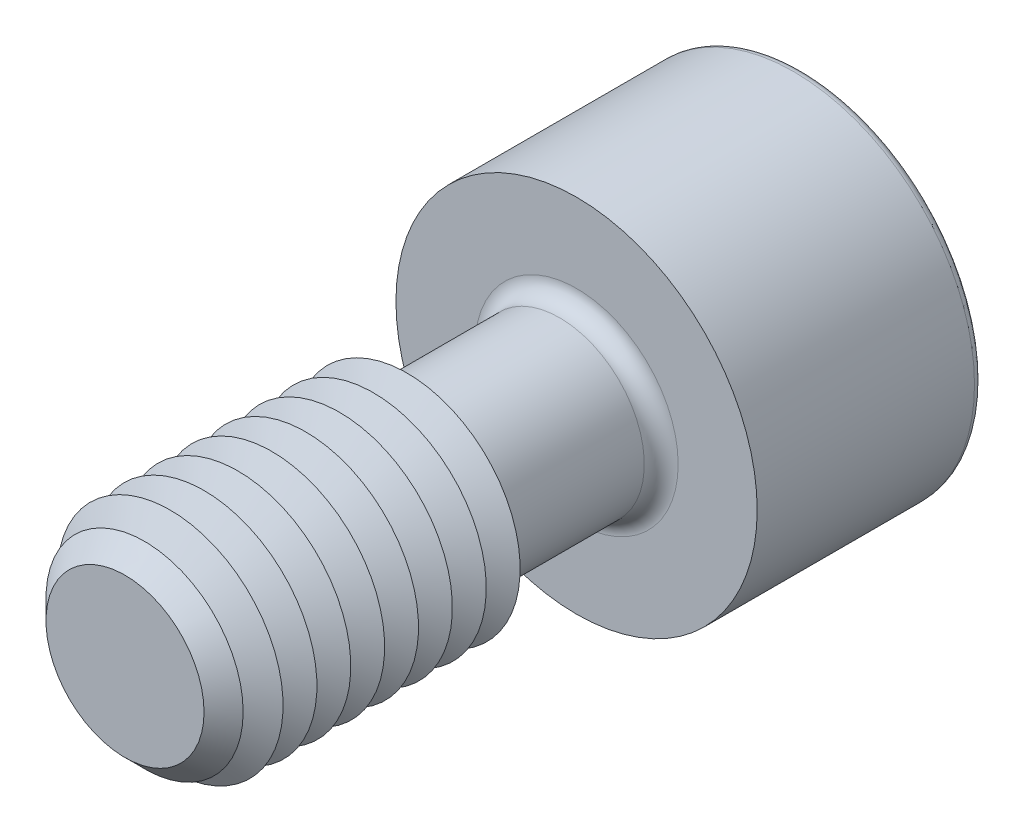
ISO-10303-21;
HEADER;
FILE_DESCRIPTION(('STEP AP214'),'2;1');
FILE_NAME('part.step','',(''),(''),'','','');
FILE_SCHEMA(('AUTOMOTIVE_DESIGN { 1 0 10303 214 1 1 1 1 }'));
ENDSEC;
DATA;
#1=APPLICATION_CONTEXT('core data for automotive mechanical design processes');
#2=APPLICATION_PROTOCOL_DEFINITION('international standard','automotive_design',2000,#1);
#3=PRODUCT_CONTEXT('',#1,'mechanical');
#4=PRODUCT('Part','Part','',(#3));
#5=PRODUCT_RELATED_PRODUCT_CATEGORY('part','',(#4));
#6=PRODUCT_DEFINITION_FORMATION('','',#4);
#7=PRODUCT_DEFINITION_CONTEXT('part definition',#1,'design');
#8=PRODUCT_DEFINITION('design','',#6,#7);
#9=PRODUCT_DEFINITION_SHAPE('','',#8);
#10=(LENGTH_UNIT() NAMED_UNIT(*) SI_UNIT(.MILLI.,.METRE.));
#11=(NAMED_UNIT(*) PLANE_ANGLE_UNIT() SI_UNIT($,.RADIAN.));
#12=(NAMED_UNIT(*) SI_UNIT($,.STERADIAN.) SOLID_ANGLE_UNIT());
#13=UNCERTAINTY_MEASURE_WITH_UNIT(LENGTH_MEASURE(1.E-05),#10,'distance_accuracy_value','');
#14=(GEOMETRIC_REPRESENTATION_CONTEXT(3) GLOBAL_UNCERTAINTY_ASSIGNED_CONTEXT((#13)) GLOBAL_UNIT_ASSIGNED_CONTEXT((#10,
#11,#12)) REPRESENTATION_CONTEXT('',''));
#15=CARTESIAN_POINT('',(0.,0.,0.));
#16=DIRECTION('',(0.,0.,1.));
#17=DIRECTION('',(1.,0.,0.));
#18=AXIS2_PLACEMENT_3D('',#15,#16,#17);
#19=CARTESIAN_POINT('',(-2.30940107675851,-4.,-12.));
#20=DIRECTION('',(0.,0.,1.));
#21=DIRECTION('',(1.,0.,0.));
#22=AXIS2_PLACEMENT_3D('',#19,#20,#21);
#23=PLANE('',#22);
#24=DIRECTION('',(1.,0.,0.));
#25=VECTOR('',#24,1.);
#26=CARTESIAN_POINT('',(-2.30940107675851,-4.,-12.));
#27=LINE('',#26,#25);
#28=CARTESIAN_POINT('',(0.,-4.,-12.));
#29=VERTEX_POINT('',#28);
#30=CARTESIAN_POINT('',(2.3094010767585,-4.,-12.));
#31=VERTEX_POINT('',#30);
#32=EDGE_CURVE('E760',#29,#31,#27,.T.);
#33=ORIENTED_EDGE('',*,*,#32,.F.);
#34=CARTESIAN_POINT('',(0.,0.,-12.));
#35=DIRECTION('',(0.,0.,1.));
#36=DIRECTION('',(0.,-1.,0.));
#37=AXIS2_PLACEMENT_3D('',#34,#35,#36);
#38=CIRCLE('',#37,4.);
#39=CARTESIAN_POINT('',(3.46410161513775,-2.,-12.));
#40=VERTEX_POINT('',#39);
#41=EDGE_CURVE('E53',#29,#40,#38,.T.);
#42=ORIENTED_EDGE('',*,*,#41,.T.);
#43=DIRECTION('',(0.500000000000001,0.866025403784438,0.));
#44=VECTOR('',#43,1.);
#45=CARTESIAN_POINT('',(2.3094010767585,-4.,-12.));
#46=LINE('',#45,#44);
#47=EDGE_CURVE('E746',#31,#40,#46,.T.);
#48=ORIENTED_EDGE('',*,*,#47,.F.);
#49=EDGE_LOOP('',(#33,#42,#48));
#50=FACE_BOUND('',#49,.T.);
#51=ADVANCED_FACE('F41',(#50),#23,.F.);
#52=CARTESIAN_POINT('',(4.61880215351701,0.,-12.));
#53=VERTEX_POINT('',#52);
#54=EDGE_CURVE('E756',#40,#53,#46,.T.);
#55=ORIENTED_EDGE('',*,*,#54,.F.);
#56=CARTESIAN_POINT('',(3.46410161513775,2.,-12.));
#57=VERTEX_POINT('',#56);
#58=EDGE_CURVE('E11',#40,#57,#38,.T.);
#59=ORIENTED_EDGE('',*,*,#58,.T.);
#60=DIRECTION('',(-0.5,0.866025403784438,0.));
#61=VECTOR('',#60,1.);
#62=CARTESIAN_POINT('',(4.61880215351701,0.,-12.));
#63=LINE('',#62,#61);
#64=EDGE_CURVE('E745',#53,#57,#63,.T.);
#65=ORIENTED_EDGE('',*,*,#64,.F.);
#66=EDGE_LOOP('',(#55,#59,#65));
#67=FACE_BOUND('',#66,.T.);
#68=ADVANCED_FACE('F133',(#67),#23,.F.);
#69=CARTESIAN_POINT('',(2.3094010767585,4.,-12.));
#70=VERTEX_POINT('',#69);
#71=EDGE_CURVE('E740',#57,#70,#63,.T.);
#72=ORIENTED_EDGE('',*,*,#71,.F.);
#73=CARTESIAN_POINT('',(0.,3.99999999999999,-12.));
#74=VERTEX_POINT('',#73);
#75=EDGE_CURVE('E51',#57,#74,#38,.T.);
#76=ORIENTED_EDGE('',*,*,#75,.T.);
#77=DIRECTION('',(-1.,0.,0.));
#78=VECTOR('',#77,1.);
#79=CARTESIAN_POINT('',(2.3094010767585,4.,-12.));
#80=LINE('',#79,#78);
#81=EDGE_CURVE('E177',#70,#74,#80,.T.);
#82=ORIENTED_EDGE('',*,*,#81,.F.);
#83=EDGE_LOOP('',(#72,#76,#82));
#84=FACE_BOUND('',#83,.T.);
#85=ADVANCED_FACE('F139',(#84),#23,.F.);
#86=CARTESIAN_POINT('',(-2.3094010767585,4.,-12.));
#87=VERTEX_POINT('',#86);
#88=EDGE_CURVE('E751',#74,#87,#80,.T.);
#89=ORIENTED_EDGE('',*,*,#88,.F.);
#90=CARTESIAN_POINT('',(-3.46410161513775,2.,-12.));
#91=VERTEX_POINT('',#90);
#92=EDGE_CURVE('E265',#74,#91,#38,.T.);
#93=ORIENTED_EDGE('',*,*,#92,.T.);
#94=DIRECTION('',(-0.5,-0.866025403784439,0.));
#95=VECTOR('',#94,1.);
#96=CARTESIAN_POINT('',(-2.3094010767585,4.,-12.));
#97=LINE('',#96,#95);
#98=EDGE_CURVE('E176',#87,#91,#97,.T.);
#99=ORIENTED_EDGE('',*,*,#98,.F.);
#100=EDGE_LOOP('',(#89,#93,#99));
#101=FACE_BOUND('',#100,.T.);
#102=ADVANCED_FACE('F157',(#101),#23,.F.);
#103=CARTESIAN_POINT('',(-4.61880215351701,0.,-12.));
#104=VERTEX_POINT('',#103);
#105=EDGE_CURVE('E170',#91,#104,#97,.T.);
#106=ORIENTED_EDGE('',*,*,#105,.F.);
#107=CARTESIAN_POINT('',(-3.46410161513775,-2.,-12.));
#108=VERTEX_POINT('',#107);
#109=EDGE_CURVE('E172',#91,#108,#38,.T.);
#110=ORIENTED_EDGE('',*,*,#109,.T.);
#111=DIRECTION('',(0.499999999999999,-0.866025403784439,0.));
#112=VECTOR('',#111,1.);
#113=CARTESIAN_POINT('',(-4.61880215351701,0.,-12.));
#114=LINE('',#113,#112);
#115=EDGE_CURVE('E174',#104,#108,#114,.T.);
#116=ORIENTED_EDGE('',*,*,#115,.F.);
#117=EDGE_LOOP('',(#106,#110,#116));
#118=FACE_BOUND('',#117,.T.);
#119=ADVANCED_FACE('F146',(#118),#23,.F.);
#120=CARTESIAN_POINT('',(0.,0.,-20.));
#121=DIRECTION('',(0.,0.,-1.));
#122=DIRECTION('',(-1.,0.,0.));
#123=AXIS2_PLACEMENT_3D('',#120,#121,#122);
#124=PLANE('',#123);
#125=CARTESIAN_POINT('',(0.,0.,-20.));
#126=DIRECTION('',(0.,0.,-1.));
#127=DIRECTION('',(-1.,0.,0.));
#128=AXIS2_PLACEMENT_3D('',#125,#126,#127);
#129=CIRCLE('',#128,7.625);
#130=CARTESIAN_POINT('',(-7.625,0.,-20.));
#131=VERTEX_POINT('',#130);
#132=EDGE_CURVE('E251',#131,#131,#129,.T.);
#133=ORIENTED_EDGE('',*,*,#132,.T.);
#134=EDGE_LOOP('',(#133));
#135=FACE_BOUND('',#134,.T.);
#136=DIRECTION('',(-0.5,-0.866025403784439,0.));
#137=VECTOR('',#136,1.);
#138=CARTESIAN_POINT('',(-2.3094010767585,4.,-20.));
#139=LINE('',#138,#137);
#140=CARTESIAN_POINT('',(-2.3094010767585,4.,-20.));
#141=VERTEX_POINT('',#140);
#142=CARTESIAN_POINT('',(-4.61880215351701,0.,-20.));
#143=VERTEX_POINT('',#142);
#144=EDGE_CURVE('E212',#141,#143,#139,.T.);
#145=ORIENTED_EDGE('',*,*,#144,.T.);
#146=DIRECTION('',(0.499999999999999,-0.866025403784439,0.));
#147=VECTOR('',#146,1.);
#148=CARTESIAN_POINT('',(-4.61880215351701,0.,-20.));
#149=LINE('',#148,#147);
#150=CARTESIAN_POINT('',(-2.30940107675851,-4.,-20.));
#151=VERTEX_POINT('',#150);
#152=EDGE_CURVE('E67',#143,#151,#149,.T.);
#153=ORIENTED_EDGE('',*,*,#152,.T.);
#154=DIRECTION('',(1.,0.,0.));
#155=VECTOR('',#154,1.);
#156=CARTESIAN_POINT('',(-2.30940107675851,-4.,-20.));
#157=LINE('',#156,#155);
#158=CARTESIAN_POINT('',(2.3094010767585,-4.,-20.));
#159=VERTEX_POINT('',#158);
#160=EDGE_CURVE('E196',#151,#159,#157,.T.);
#161=ORIENTED_EDGE('',*,*,#160,.T.);
#162=DIRECTION('',(0.500000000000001,0.866025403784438,0.));
#163=VECTOR('',#162,1.);
#164=CARTESIAN_POINT('',(2.3094010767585,-4.,-20.));
#165=LINE('',#164,#163);
#166=CARTESIAN_POINT('',(4.61880215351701,0.,-20.));
#167=VERTEX_POINT('',#166);
#168=EDGE_CURVE('E200',#159,#167,#165,.T.);
#169=ORIENTED_EDGE('',*,*,#168,.T.);
#170=DIRECTION('',(-0.5,0.866025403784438,0.));
#171=VECTOR('',#170,1.);
#172=CARTESIAN_POINT('',(4.61880215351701,0.,-20.));
#173=LINE('',#172,#171);
#174=CARTESIAN_POINT('',(2.3094010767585,4.,-20.));
#175=VERTEX_POINT('',#174);
#176=EDGE_CURVE('E204',#167,#175,#173,.T.);
#177=ORIENTED_EDGE('',*,*,#176,.T.);
#178=DIRECTION('',(-1.,0.,0.));
#179=VECTOR('',#178,1.);
#180=CARTESIAN_POINT('',(2.3094010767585,4.,-20.));
#181=LINE('',#180,#179);
#182=EDGE_CURVE('E208',#175,#141,#181,.T.);
#183=ORIENTED_EDGE('',*,*,#182,.T.);
#184=EDGE_LOOP('',(#145,#153,#161,#169,#177,#183));
#185=FACE_BOUND('',#184,.T.);
#186=ADVANCED_FACE('F156',(#135,#185),#124,.T.);
#187=CARTESIAN_POINT('',(0.,0.,10.));
#188=DIRECTION('',(0.,0.,-1.));
#189=DIRECTION('',(-1.,0.,0.));
#190=AXIS2_PLACEMENT_3D('',#187,#188,#189);
#191=CYLINDRICAL_SURFACE('',#190,3.75);
#192=CARTESIAN_POINT('',(0.,0.,-9.25));
#193=DIRECTION('',(0.,0.,-1.));
#194=DIRECTION('',(-1.,0.,0.));
#195=AXIS2_PLACEMENT_3D('',#192,#193,#194);
#196=CIRCLE('',#195,3.75);
#197=CARTESIAN_POINT('',(-3.75,0.,-9.25));
#198=VERTEX_POINT('',#197);
#199=EDGE_CURVE('E247',#198,#198,#196,.F.);
#200=ORIENTED_EDGE('',*,*,#199,.T.);
#201=EDGE_LOOP('',(#200));
#202=FACE_BOUND('',#201,.T.);
#203=CARTESIAN_POINT('',(0.,0.,-3.22168783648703));
#204=DIRECTION('',(0.,0.,-1.));
#205=DIRECTION('',(0.,1.,0.));
#206=AXIS2_PLACEMENT_3D('',#203,#204,#205);
#207=CIRCLE('',#206,3.75);
#208=CARTESIAN_POINT('',(0.,3.75,-3.22168783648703));
#209=VERTEX_POINT('',#208);
#210=EDGE_CURVE('E235',#209,#209,#207,.T.);
#211=ORIENTED_EDGE('',*,*,#210,.T.);
#212=EDGE_LOOP('',(#211));
#213=FACE_BOUND('',#212,.T.);
#214=ADVANCED_FACE('F163',(#202,#213),#191,.T.);
#215=CARTESIAN_POINT('',(0.,0.,-3.22168783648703));
#216=DIRECTION('',(0.,0.,1.));
#217=DIRECTION('',(0.,-1.,0.));
#218=AXIS2_PLACEMENT_3D('',#215,#216,#217);
#219=CONICAL_SURFACE('',#218,3.75,1.0471975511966);
#220=CARTESIAN_POINT('',(0.,0.,-2.5));
#221=DIRECTION('',(0.,0.,-1.));
#222=DIRECTION('',(-1.,0.,0.));
#223=AXIS2_PLACEMENT_3D('',#220,#221,#222);
#224=CIRCLE('',#223,5.);
#225=CARTESIAN_POINT('',(-5.,0.,-2.5));
#226=VERTEX_POINT('',#225);
#227=EDGE_CURVE('E269',#226,#226,#224,.T.);
#228=ORIENTED_EDGE('',*,*,#227,.T.);
#229=EDGE_LOOP('',(#228));
#230=FACE_BOUND('',#229,.T.);
#231=ORIENTED_EDGE('',*,*,#210,.F.);
#232=EDGE_LOOP('',(#231));
#233=FACE_BOUND('',#232,.T.);
#234=ADVANCED_FACE('F509',(#230,#233),#219,.T.);
#235=CARTESIAN_POINT('',(0.,0.,-10.));
#236=DIRECTION('',(0.,0.,-1.));
#237=DIRECTION('',(-1.,0.,0.));
#238=AXIS2_PLACEMENT_3D('',#235,#236,#237);
#239=PLANE('',#238);
#240=CARTESIAN_POINT('',(0.,0.,-10.));
#241=DIRECTION('',(0.,0.,-1.));
#242=DIRECTION('',(-1.,0.,0.));
#243=AXIS2_PLACEMENT_3D('',#240,#241,#242);
#244=CIRCLE('',#243,4.5);
#245=CARTESIAN_POINT('',(-4.5,0.,-10.));
#246=VERTEX_POINT('',#245);
#247=EDGE_CURVE('E243',#246,#246,#244,.T.);
#248=ORIENTED_EDGE('',*,*,#247,.T.);
#249=EDGE_LOOP('',(#248));
#250=FACE_BOUND('',#249,.T.);
#251=CARTESIAN_POINT('',(0.,0.,-10.));
#252=DIRECTION('',(0.,0.,-1.));
#253=DIRECTION('',(-1.,0.,0.));
#254=AXIS2_PLACEMENT_3D('',#251,#252,#253);
#255=CIRCLE('',#254,8.);
#256=CARTESIAN_POINT('',(-8.,0.,-10.));
#257=VERTEX_POINT('',#256);
#258=EDGE_CURVE('E231',#257,#257,#255,.T.);
#259=ORIENTED_EDGE('',*,*,#258,.F.);
#260=EDGE_LOOP('',(#259));
#261=FACE_BOUND('',#260,.T.);
#262=ADVANCED_FACE('F502',(#250,#261),#239,.F.);
#263=CARTESIAN_POINT('',(0.,0.,-20.));
#264=DIRECTION('',(0.,0.,1.));
#265=DIRECTION('',(1.,0.,0.));
#266=AXIS2_PLACEMENT_3D('',#263,#264,#265);
#267=CYLINDRICAL_SURFACE('',#266,8.);
#268=CARTESIAN_POINT('',(0.,0.,-19.625));
#269=DIRECTION('',(0.,0.,-1.));
#270=DIRECTION('',(-1.,0.,0.));
#271=AXIS2_PLACEMENT_3D('',#268,#269,#270);
#272=CIRCLE('',#271,8.);
#273=CARTESIAN_POINT('',(-8.,0.,-19.625));
#274=VERTEX_POINT('',#273);
#275=EDGE_CURVE('E254',#274,#274,#272,.F.);
#276=ORIENTED_EDGE('',*,*,#275,.T.);
#277=EDGE_LOOP('',(#276));
#278=FACE_BOUND('',#277,.T.);
#279=ORIENTED_EDGE('',*,*,#258,.T.);
#280=EDGE_LOOP('',(#279));
#281=FACE_BOUND('',#280,.T.);
#282=ADVANCED_FACE('F508',(#278,#281),#267,.T.);
#283=CARTESIAN_POINT('',(-4.61880215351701,0.,-12.));
#284=DIRECTION('',(0.866025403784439,0.5,0.));
#285=DIRECTION('',(-0.499999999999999,0.866025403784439,0.));
#286=AXIS2_PLACEMENT_3D('',#283,#284,#285);
#287=PLANE('',#286);
#288=ORIENTED_EDGE('',*,*,#152,.F.);
#289=DIRECTION('',(0.,0.,-1.));
#290=VECTOR('',#289,1.);
#291=CARTESIAN_POINT('',(-4.61880215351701,0.,-12.));
#292=LINE('',#291,#290);
#293=EDGE_CURVE('E186',#104,#143,#292,.T.);
#294=ORIENTED_EDGE('',*,*,#293,.F.);
#295=ORIENTED_EDGE('',*,*,#115,.T.);
#296=CARTESIAN_POINT('',(-2.30940107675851,-4.,-12.));
#297=VERTEX_POINT('',#296);
#298=EDGE_CURVE('E215',#108,#297,#114,.T.);
#299=ORIENTED_EDGE('',*,*,#298,.T.);
#300=DIRECTION('',(0.,0.,-1.));
#301=VECTOR('',#300,1.);
#302=CARTESIAN_POINT('',(-2.30940107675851,-4.,-12.));
#303=LINE('',#302,#301);
#304=EDGE_CURVE('E228',#297,#151,#303,.T.);
#305=ORIENTED_EDGE('',*,*,#304,.T.);
#306=EDGE_LOOP('',(#288,#294,#295,#299,#305));
#307=FACE_BOUND('',#306,.T.);
#308=ADVANCED_FACE('F520',(#307),#287,.T.);
#309=CARTESIAN_POINT('',(-2.30940107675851,-4.,-12.));
#310=DIRECTION('',(0.,1.,0.));
#311=DIRECTION('',(-1.,0.,0.));
#312=AXIS2_PLACEMENT_3D('',#309,#310,#311);
#313=PLANE('',#312);
#314=ORIENTED_EDGE('',*,*,#160,.F.);
#315=ORIENTED_EDGE('',*,*,#304,.F.);
#316=EDGE_CURVE('E757',#297,#29,#27,.T.);
#317=ORIENTED_EDGE('',*,*,#316,.T.);
#318=ORIENTED_EDGE('',*,*,#32,.T.);
#319=DIRECTION('',(0.,0.,-1.));
#320=VECTOR('',#319,1.);
#321=CARTESIAN_POINT('',(2.3094010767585,-4.,-12.));
#322=LINE('',#321,#320);
#323=EDGE_CURVE('E225',#31,#159,#322,.T.);
#324=ORIENTED_EDGE('',*,*,#323,.T.);
#325=EDGE_LOOP('',(#314,#315,#317,#318,#324));
#326=FACE_BOUND('',#325,.T.);
#327=ADVANCED_FACE('F536',(#326),#313,.T.);
#328=CARTESIAN_POINT('',(2.3094010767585,-4.,-12.));
#329=DIRECTION('',(-0.866025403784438,0.500000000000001,0.));
#330=DIRECTION('',(-0.500000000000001,-0.866025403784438,0.));
#331=AXIS2_PLACEMENT_3D('',#328,#329,#330);
#332=PLANE('',#331);
#333=ORIENTED_EDGE('',*,*,#168,.F.);
#334=ORIENTED_EDGE('',*,*,#323,.F.);
#335=ORIENTED_EDGE('',*,*,#47,.T.);
#336=ORIENTED_EDGE('',*,*,#54,.T.);
#337=DIRECTION('',(0.,0.,-1.));
#338=VECTOR('',#337,1.);
#339=CARTESIAN_POINT('',(4.61880215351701,0.,-12.));
#340=LINE('',#339,#338);
#341=EDGE_CURVE('E222',#53,#167,#340,.T.);
#342=ORIENTED_EDGE('',*,*,#341,.T.);
#343=EDGE_LOOP('',(#333,#334,#335,#336,#342));
#344=FACE_BOUND('',#343,.T.);
#345=ADVANCED_FACE('F546',(#344),#332,.T.);
#346=CARTESIAN_POINT('',(4.61880215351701,0.,-12.));
#347=DIRECTION('',(-0.866025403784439,-0.5,0.));
#348=DIRECTION('',(0.5,-0.866025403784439,0.));
#349=AXIS2_PLACEMENT_3D('',#346,#347,#348);
#350=PLANE('',#349);
#351=ORIENTED_EDGE('',*,*,#176,.F.);
#352=ORIENTED_EDGE('',*,*,#341,.F.);
#353=ORIENTED_EDGE('',*,*,#64,.T.);
#354=ORIENTED_EDGE('',*,*,#71,.T.);
#355=DIRECTION('',(0.,0.,-1.));
#356=VECTOR('',#355,1.);
#357=CARTESIAN_POINT('',(2.3094010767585,4.,-12.));
#358=LINE('',#357,#356);
#359=EDGE_CURVE('E219',#70,#175,#358,.T.);
#360=ORIENTED_EDGE('',*,*,#359,.T.);
#361=EDGE_LOOP('',(#351,#352,#353,#354,#360));
#362=FACE_BOUND('',#361,.T.);
#363=ADVANCED_FACE('F556',(#362),#350,.T.);
#364=CARTESIAN_POINT('',(2.3094010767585,4.,-12.));
#365=DIRECTION('',(0.,-1.,0.));
#366=DIRECTION('',(0.,0.,-1.));
#367=AXIS2_PLACEMENT_3D('',#364,#365,#366);
#368=PLANE('',#367);
#369=ORIENTED_EDGE('',*,*,#182,.F.);
#370=ORIENTED_EDGE('',*,*,#359,.F.);
#371=ORIENTED_EDGE('',*,*,#81,.T.);
#372=ORIENTED_EDGE('',*,*,#88,.T.);
#373=DIRECTION('',(0.,0.,-1.));
#374=VECTOR('',#373,1.);
#375=CARTESIAN_POINT('',(-2.3094010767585,4.,-12.));
#376=LINE('',#375,#374);
#377=EDGE_CURVE('E182',#87,#141,#376,.T.);
#378=ORIENTED_EDGE('',*,*,#377,.T.);
#379=EDGE_LOOP('',(#369,#370,#371,#372,#378));
#380=FACE_BOUND('',#379,.T.);
#381=ADVANCED_FACE('F152',(#380),#368,.T.);
#382=CARTESIAN_POINT('',(-2.3094010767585,4.,-12.));
#383=DIRECTION('',(0.866025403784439,-0.5,0.));
#384=DIRECTION('',(0.5,0.866025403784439,0.));
#385=AXIS2_PLACEMENT_3D('',#382,#383,#384);
#386=PLANE('',#385);
#387=ORIENTED_EDGE('',*,*,#144,.F.);
#388=ORIENTED_EDGE('',*,*,#377,.F.);
#389=ORIENTED_EDGE('',*,*,#98,.T.);
#390=ORIENTED_EDGE('',*,*,#105,.T.);
#391=ORIENTED_EDGE('',*,*,#293,.T.);
#392=EDGE_LOOP('',(#387,#388,#389,#390,#391));
#393=FACE_BOUND('',#392,.T.);
#394=ADVANCED_FACE('F144',(#393),#386,.T.);
#395=ORIENTED_EDGE('',*,*,#298,.F.);
#396=EDGE_CURVE('E257',#108,#29,#38,.T.);
#397=ORIENTED_EDGE('',*,*,#396,.T.);
#398=ORIENTED_EDGE('',*,*,#316,.F.);
#399=EDGE_LOOP('',(#395,#397,#398));
#400=FACE_BOUND('',#399,.T.);
#401=ADVANCED_FACE('F135',(#400),#23,.F.);
#402=CARTESIAN_POINT('',(0.,0.,-9.25));
#403=DIRECTION('',(0.,0.,-1.));
#404=DIRECTION('',(-1.,0.,0.));
#405=AXIS2_PLACEMENT_3D('',#402,#403,#404);
#406=TOROIDAL_SURFACE('',#405,4.5,0.75);
#407=ORIENTED_EDGE('',*,*,#199,.F.);
#408=EDGE_LOOP('',(#407));
#409=FACE_BOUND('',#408,.T.);
#410=ORIENTED_EDGE('',*,*,#247,.F.);
#411=EDGE_LOOP('',(#410));
#412=FACE_BOUND('',#411,.T.);
#413=ADVANCED_FACE('F129',(#409,#412),#406,.F.);
#414=CARTESIAN_POINT('',(0.,0.,-19.625));
#415=DIRECTION('',(0.,0.,-1.));
#416=DIRECTION('',(-1.,0.,0.));
#417=AXIS2_PLACEMENT_3D('',#414,#415,#416);
#418=TOROIDAL_SURFACE('',#417,7.625,0.375);
#419=ORIENTED_EDGE('',*,*,#275,.F.);
#420=EDGE_LOOP('',(#419));
#421=FACE_BOUND('',#420,.T.);
#422=ORIENTED_EDGE('',*,*,#132,.F.);
#423=EDGE_LOOP('',(#422));
#424=FACE_BOUND('',#423,.T.);
#425=ADVANCED_FACE('F43',(#421,#424),#418,.T.);
#426=CARTESIAN_POINT('',(0.,0.,-9.69059892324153));
#427=DIRECTION('',(0.,0.,-1.));
#428=DIRECTION('',(0.,1.,0.));
#429=AXIS2_PLACEMENT_3D('',#426,#427,#428);
#430=CONICAL_SURFACE('',#429,0.,1.0471975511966);
#431=ORIENTED_EDGE('',*,*,#41,.F.);
#432=ORIENTED_EDGE('',*,*,#396,.F.);
#433=ORIENTED_EDGE('',*,*,#109,.F.);
#434=ORIENTED_EDGE('',*,*,#92,.F.);
#435=ORIENTED_EDGE('',*,*,#75,.F.);
#436=ORIENTED_EDGE('',*,*,#58,.F.);
#437=EDGE_LOOP('',(#431,#432,#433,#434,#435,#436));
#438=FACE_BOUND('',#437,.T.);
#439=CARTESIAN_POINT('',(0.,0.,-9.69059892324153));
#440=VERTEX_POINT('',#439);
#441=VERTEX_LOOP('',#440);
#442=FACE_BOUND('',#441,.T.);
#443=ADVANCED_FACE('F118',(#438,#442),#430,.F.);
#444=CARTESIAN_POINT('',(0.,0.,-1.75));
#445=DIRECTION('',(0.,0.,-1.));
#446=DIRECTION('',(-1.,0.,0.));
#447=AXIS2_PLACEMENT_3D('',#444,#445,#446);
#448=CONICAL_SURFACE('',#447,3.70096189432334,1.0471975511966);
#449=ORIENTED_EDGE('',*,*,#227,.F.);
#450=EDGE_LOOP('',(#449));
#451=FACE_BOUND('',#450,.T.);
#452=CARTESIAN_POINT('',(0.,0.,-1.75));
#453=DIRECTION('',(0.,0.,-1.));
#454=DIRECTION('',(-1.,0.,0.));
#455=AXIS2_PLACEMENT_3D('',#452,#453,#454);
#456=CIRCLE('',#455,3.70096189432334);
#457=CARTESIAN_POINT('',(-3.70096189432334,0.,-1.75));
#458=VERTEX_POINT('',#457);
#459=EDGE_CURVE('E275',#458,#458,#456,.T.);
#460=ORIENTED_EDGE('',*,*,#459,.T.);
#461=EDGE_LOOP('',(#460));
#462=FACE_BOUND('',#461,.T.);
#463=ADVANCED_FACE('F120',(#451,#462),#448,.T.);
#464=CARTESIAN_POINT('',(0.,0.,-1.));
#465=DIRECTION('',(0.,0.,1.));
#466=DIRECTION('',(1.,0.,0.));
#467=AXIS2_PLACEMENT_3D('',#464,#465,#466);
#468=CONICAL_SURFACE('',#467,5.,1.0471975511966);
#469=ORIENTED_EDGE('',*,*,#459,.F.);
#470=EDGE_LOOP('',(#469));
#471=FACE_BOUND('',#470,.T.);
#472=CARTESIAN_POINT('',(0.,0.,-1.));
#473=DIRECTION('',(0.,0.,-1.));
#474=DIRECTION('',(-1.,0.,0.));
#475=AXIS2_PLACEMENT_3D('',#472,#473,#474);
#476=CIRCLE('',#475,5.);
#477=CARTESIAN_POINT('',(-5.,0.,-1.));
#478=VERTEX_POINT('',#477);
#479=EDGE_CURVE('E280',#478,#478,#476,.T.);
#480=ORIENTED_EDGE('',*,*,#479,.T.);
#481=EDGE_LOOP('',(#480));
#482=FACE_BOUND('',#481,.T.);
#483=ADVANCED_FACE('F126',(#471,#482),#468,.T.);
#484=CARTESIAN_POINT('',(0.,0.,-0.250000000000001));
#485=DIRECTION('',(0.,0.,-1.));
#486=DIRECTION('',(-1.,0.,0.));
#487=AXIS2_PLACEMENT_3D('',#484,#485,#486);
#488=CONICAL_SURFACE('',#487,3.70096189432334,1.0471975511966);
#489=ORIENTED_EDGE('',*,*,#479,.F.);
#490=EDGE_LOOP('',(#489));
#491=FACE_BOUND('',#490,.T.);
#492=CARTESIAN_POINT('',(0.,0.,-0.250000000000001));
#493=DIRECTION('',(0.,0.,-1.));
#494=DIRECTION('',(-1.,0.,0.));
#495=AXIS2_PLACEMENT_3D('',#492,#493,#494);
#496=CIRCLE('',#495,3.70096189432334);
#497=CARTESIAN_POINT('',(-3.70096189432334,0.,-0.250000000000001));
#498=VERTEX_POINT('',#497);
#499=EDGE_CURVE('E286',#498,#498,#496,.T.);
#500=ORIENTED_EDGE('',*,*,#499,.T.);
#501=EDGE_LOOP('',(#500));
#502=FACE_BOUND('',#501,.T.);
#503=ADVANCED_FACE('F396',(#491,#502),#488,.T.);
#504=CARTESIAN_POINT('',(0.,0.,0.499999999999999));
#505=DIRECTION('',(0.,0.,1.));
#506=DIRECTION('',(1.,0.,0.));
#507=AXIS2_PLACEMENT_3D('',#504,#505,#506);
#508=CONICAL_SURFACE('',#507,5.,1.0471975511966);
#509=ORIENTED_EDGE('',*,*,#499,.F.);
#510=EDGE_LOOP('',(#509));
#511=FACE_BOUND('',#510,.T.);
#512=CARTESIAN_POINT('',(0.,0.,0.499999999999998));
#513=DIRECTION('',(0.,0.,-1.));
#514=DIRECTION('',(-1.,0.,0.));
#515=AXIS2_PLACEMENT_3D('',#512,#513,#514);
#516=CIRCLE('',#515,5.);
#517=CARTESIAN_POINT('',(-5.,0.,0.499999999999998));
#518=VERTEX_POINT('',#517);
#519=EDGE_CURVE('E290',#518,#518,#516,.T.);
#520=ORIENTED_EDGE('',*,*,#519,.T.);
#521=EDGE_LOOP('',(#520));
#522=FACE_BOUND('',#521,.T.);
#523=ADVANCED_FACE('F392',(#511,#522),#508,.T.);
#524=CARTESIAN_POINT('',(0.,0.,1.25));
#525=DIRECTION('',(0.,0.,-1.));
#526=DIRECTION('',(-1.,0.,0.));
#527=AXIS2_PLACEMENT_3D('',#524,#525,#526);
#528=CONICAL_SURFACE('',#527,3.70096189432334,1.0471975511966);
#529=ORIENTED_EDGE('',*,*,#519,.F.);
#530=EDGE_LOOP('',(#529));
#531=FACE_BOUND('',#530,.T.);
#532=CARTESIAN_POINT('',(0.,0.,1.25));
#533=DIRECTION('',(0.,0.,-1.));
#534=DIRECTION('',(-1.,0.,0.));
#535=AXIS2_PLACEMENT_3D('',#532,#533,#534);
#536=CIRCLE('',#535,3.70096189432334);
#537=CARTESIAN_POINT('',(-3.70096189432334,0.,1.25));
#538=VERTEX_POINT('',#537);
#539=EDGE_CURVE('E293',#538,#538,#536,.T.);
#540=ORIENTED_EDGE('',*,*,#539,.T.);
#541=EDGE_LOOP('',(#540));
#542=FACE_BOUND('',#541,.T.);
#543=ADVANCED_FACE('F388',(#531,#542),#528,.T.);
#544=CARTESIAN_POINT('',(0.,0.,2.));
#545=DIRECTION('',(0.,0.,1.));
#546=DIRECTION('',(1.,0.,0.));
#547=AXIS2_PLACEMENT_3D('',#544,#545,#546);
#548=CONICAL_SURFACE('',#547,5.,1.0471975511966);
#549=ORIENTED_EDGE('',*,*,#539,.F.);
#550=EDGE_LOOP('',(#549));
#551=FACE_BOUND('',#550,.T.);
#552=CARTESIAN_POINT('',(0.,0.,2.));
#553=DIRECTION('',(0.,0.,-1.));
#554=DIRECTION('',(-1.,0.,0.));
#555=AXIS2_PLACEMENT_3D('',#552,#553,#554);
#556=CIRCLE('',#555,5.);
#557=CARTESIAN_POINT('',(-5.,0.,2.));
#558=VERTEX_POINT('',#557);
#559=EDGE_CURVE('E296',#558,#558,#556,.T.);
#560=ORIENTED_EDGE('',*,*,#559,.T.);
#561=EDGE_LOOP('',(#560));
#562=FACE_BOUND('',#561,.T.);
#563=ADVANCED_FACE('F384',(#551,#562),#548,.T.);
#564=CARTESIAN_POINT('',(0.,0.,2.75));
#565=DIRECTION('',(0.,0.,-1.));
#566=DIRECTION('',(-1.,0.,0.));
#567=AXIS2_PLACEMENT_3D('',#564,#565,#566);
#568=CONICAL_SURFACE('',#567,3.70096189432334,1.0471975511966);
#569=ORIENTED_EDGE('',*,*,#559,.F.);
#570=EDGE_LOOP('',(#569));
#571=FACE_BOUND('',#570,.T.);
#572=CARTESIAN_POINT('',(0.,0.,2.75));
#573=DIRECTION('',(0.,0.,-1.));
#574=DIRECTION('',(-1.,0.,0.));
#575=AXIS2_PLACEMENT_3D('',#572,#573,#574);
#576=CIRCLE('',#575,3.70096189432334);
#577=CARTESIAN_POINT('',(-3.70096189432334,0.,2.75));
#578=VERTEX_POINT('',#577);
#579=EDGE_CURVE('E299',#578,#578,#576,.T.);
#580=ORIENTED_EDGE('',*,*,#579,.T.);
#581=EDGE_LOOP('',(#580));
#582=FACE_BOUND('',#581,.T.);
#583=ADVANCED_FACE('F380',(#571,#582),#568,.T.);
#584=CARTESIAN_POINT('',(0.,0.,3.5));
#585=DIRECTION('',(0.,0.,1.));
#586=DIRECTION('',(1.,0.,0.));
#587=AXIS2_PLACEMENT_3D('',#584,#585,#586);
#588=CONICAL_SURFACE('',#587,5.,1.0471975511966);
#589=ORIENTED_EDGE('',*,*,#579,.F.);
#590=EDGE_LOOP('',(#589));
#591=FACE_BOUND('',#590,.T.);
#592=CARTESIAN_POINT('',(0.,0.,3.5));
#593=DIRECTION('',(0.,0.,-1.));
#594=DIRECTION('',(-1.,0.,0.));
#595=AXIS2_PLACEMENT_3D('',#592,#593,#594);
#596=CIRCLE('',#595,5.);
#597=CARTESIAN_POINT('',(-5.,0.,3.5));
#598=VERTEX_POINT('',#597);
#599=EDGE_CURVE('E303',#598,#598,#596,.T.);
#600=ORIENTED_EDGE('',*,*,#599,.T.);
#601=EDGE_LOOP('',(#600));
#602=FACE_BOUND('',#601,.T.);
#603=ADVANCED_FACE('F376',(#591,#602),#588,.T.);
#604=CARTESIAN_POINT('',(0.,0.,4.25));
#605=DIRECTION('',(0.,0.,-1.));
#606=DIRECTION('',(-1.,0.,0.));
#607=AXIS2_PLACEMENT_3D('',#604,#605,#606);
#608=CONICAL_SURFACE('',#607,3.70096189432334,1.0471975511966);
#609=ORIENTED_EDGE('',*,*,#599,.F.);
#610=EDGE_LOOP('',(#609));
#611=FACE_BOUND('',#610,.T.);
#612=CARTESIAN_POINT('',(0.,0.,4.25));
#613=DIRECTION('',(0.,0.,-1.));
#614=DIRECTION('',(-1.,0.,0.));
#615=AXIS2_PLACEMENT_3D('',#612,#613,#614);
#616=CIRCLE('',#615,3.70096189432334);
#617=CARTESIAN_POINT('',(-3.70096189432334,0.,4.25));
#618=VERTEX_POINT('',#617);
#619=EDGE_CURVE('E307',#618,#618,#616,.T.);
#620=ORIENTED_EDGE('',*,*,#619,.T.);
#621=EDGE_LOOP('',(#620));
#622=FACE_BOUND('',#621,.T.);
#623=ADVANCED_FACE('F372',(#611,#622),#608,.T.);
#624=CARTESIAN_POINT('',(0.,0.,5.));
#625=DIRECTION('',(0.,0.,1.));
#626=DIRECTION('',(1.,0.,0.));
#627=AXIS2_PLACEMENT_3D('',#624,#625,#626);
#628=CONICAL_SURFACE('',#627,5.,1.0471975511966);
#629=ORIENTED_EDGE('',*,*,#619,.F.);
#630=EDGE_LOOP('',(#629));
#631=FACE_BOUND('',#630,.T.);
#632=CARTESIAN_POINT('',(0.,0.,5.));
#633=DIRECTION('',(0.,0.,-1.));
#634=DIRECTION('',(-1.,0.,0.));
#635=AXIS2_PLACEMENT_3D('',#632,#633,#634);
#636=CIRCLE('',#635,5.);
#637=CARTESIAN_POINT('',(-5.,0.,5.));
#638=VERTEX_POINT('',#637);
#639=EDGE_CURVE('E311',#638,#638,#636,.T.);
#640=ORIENTED_EDGE('',*,*,#639,.T.);
#641=EDGE_LOOP('',(#640));
#642=FACE_BOUND('',#641,.T.);
#643=ADVANCED_FACE('F368',(#631,#642),#628,.T.);
#644=CARTESIAN_POINT('',(0.,0.,5.75));
#645=DIRECTION('',(0.,0.,-1.));
#646=DIRECTION('',(-1.,0.,0.));
#647=AXIS2_PLACEMENT_3D('',#644,#645,#646);
#648=CONICAL_SURFACE('',#647,3.70096189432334,1.0471975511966);
#649=ORIENTED_EDGE('',*,*,#639,.F.);
#650=EDGE_LOOP('',(#649));
#651=FACE_BOUND('',#650,.T.);
#652=CARTESIAN_POINT('',(0.,0.,5.75));
#653=DIRECTION('',(0.,0.,-1.));
#654=DIRECTION('',(-1.,0.,0.));
#655=AXIS2_PLACEMENT_3D('',#652,#653,#654);
#656=CIRCLE('',#655,3.70096189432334);
#657=CARTESIAN_POINT('',(-3.70096189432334,0.,5.75));
#658=VERTEX_POINT('',#657);
#659=EDGE_CURVE('E315',#658,#658,#656,.T.);
#660=ORIENTED_EDGE('',*,*,#659,.T.);
#661=EDGE_LOOP('',(#660));
#662=FACE_BOUND('',#661,.T.);
#663=ADVANCED_FACE('F364',(#651,#662),#648,.T.);
#664=CARTESIAN_POINT('',(0.,0.,6.5));
#665=DIRECTION('',(0.,0.,1.));
#666=DIRECTION('',(1.,0.,0.));
#667=AXIS2_PLACEMENT_3D('',#664,#665,#666);
#668=CONICAL_SURFACE('',#667,5.,1.0471975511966);
#669=ORIENTED_EDGE('',*,*,#659,.F.);
#670=EDGE_LOOP('',(#669));
#671=FACE_BOUND('',#670,.T.);
#672=CARTESIAN_POINT('',(0.,0.,6.5));
#673=DIRECTION('',(0.,0.,-1.));
#674=DIRECTION('',(-1.,0.,0.));
#675=AXIS2_PLACEMENT_3D('',#672,#673,#674);
#676=CIRCLE('',#675,5.);
#677=CARTESIAN_POINT('',(-5.,0.,6.5));
#678=VERTEX_POINT('',#677);
#679=EDGE_CURVE('E319',#678,#678,#676,.T.);
#680=ORIENTED_EDGE('',*,*,#679,.T.);
#681=EDGE_LOOP('',(#680));
#682=FACE_BOUND('',#681,.T.);
#683=ADVANCED_FACE('F360',(#671,#682),#668,.T.);
#684=CARTESIAN_POINT('',(0.,0.,7.25));
#685=DIRECTION('',(0.,0.,-1.));
#686=DIRECTION('',(-1.,0.,0.));
#687=AXIS2_PLACEMENT_3D('',#684,#685,#686);
#688=CONICAL_SURFACE('',#687,3.70096189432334,1.0471975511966);
#689=ORIENTED_EDGE('',*,*,#679,.F.);
#690=EDGE_LOOP('',(#689));
#691=FACE_BOUND('',#690,.T.);
#692=CARTESIAN_POINT('',(0.,0.,7.25));
#693=DIRECTION('',(0.,0.,-1.));
#694=DIRECTION('',(-1.,0.,0.));
#695=AXIS2_PLACEMENT_3D('',#692,#693,#694);
#696=CIRCLE('',#695,3.70096189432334);
#697=CARTESIAN_POINT('',(-3.70096189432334,0.,7.25));
#698=VERTEX_POINT('',#697);
#699=EDGE_CURVE('E323',#698,#698,#696,.T.);
#700=ORIENTED_EDGE('',*,*,#699,.T.);
#701=EDGE_LOOP('',(#700));
#702=FACE_BOUND('',#701,.T.);
#703=ADVANCED_FACE('F356',(#691,#702),#688,.T.);
#704=CARTESIAN_POINT('',(0.,0.,8.));
#705=DIRECTION('',(0.,0.,1.));
#706=DIRECTION('',(1.,0.,0.));
#707=AXIS2_PLACEMENT_3D('',#704,#705,#706);
#708=CONICAL_SURFACE('',#707,5.,1.0471975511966);
#709=ORIENTED_EDGE('',*,*,#699,.F.);
#710=EDGE_LOOP('',(#709));
#711=FACE_BOUND('',#710,.T.);
#712=CARTESIAN_POINT('',(0.,0.,8.));
#713=DIRECTION('',(0.,0.,-1.));
#714=DIRECTION('',(-1.,0.,0.));
#715=AXIS2_PLACEMENT_3D('',#712,#713,#714);
#716=CIRCLE('',#715,5.);
#717=CARTESIAN_POINT('',(-5.,0.,8.));
#718=VERTEX_POINT('',#717);
#719=EDGE_CURVE('E327',#718,#718,#716,.T.);
#720=ORIENTED_EDGE('',*,*,#719,.T.);
#721=EDGE_LOOP('',(#720));
#722=FACE_BOUND('',#721,.T.);
#723=ADVANCED_FACE('F349',(#711,#722),#708,.T.);
#724=CARTESIAN_POINT('',(0.,0.,8.75));
#725=DIRECTION('',(0.,0.,-1.));
#726=DIRECTION('',(-1.,0.,0.));
#727=AXIS2_PLACEMENT_3D('',#724,#725,#726);
#728=CONICAL_SURFACE('',#727,3.70096189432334,1.0471975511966);
#729=ORIENTED_EDGE('',*,*,#719,.F.);
#730=EDGE_LOOP('',(#729));
#731=FACE_BOUND('',#730,.T.);
#732=CARTESIAN_POINT('',(0.,0.,8.75));
#733=DIRECTION('',(0.,0.,-1.));
#734=DIRECTION('',(-1.,0.,0.));
#735=AXIS2_PLACEMENT_3D('',#732,#733,#734);
#736=CIRCLE('',#735,3.70096189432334);
#737=CARTESIAN_POINT('',(-3.70096189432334,0.,8.75));
#738=VERTEX_POINT('',#737);
#739=EDGE_CURVE('E330',#738,#738,#736,.T.);
#740=ORIENTED_EDGE('',*,*,#739,.T.);
#741=EDGE_LOOP('',(#740));
#742=FACE_BOUND('',#741,.T.);
#743=ADVANCED_FACE('F335',(#731,#742),#728,.T.);
#744=CARTESIAN_POINT('',(0.,0.,9.5));
#745=DIRECTION('',(0.,0.,1.));
#746=DIRECTION('',(1.,0.,0.));
#747=AXIS2_PLACEMENT_3D('',#744,#745,#746);
#748=CONICAL_SURFACE('',#747,5.,1.0471975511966);
#749=CARTESIAN_POINT('',(0.,0.,9.13397459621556));
#750=DIRECTION('',(0.,0.,1.));
#751=DIRECTION('',(1.,0.,0.));
#752=AXIS2_PLACEMENT_3D('',#749,#750,#751);
#753=CIRCLE('',#752,4.36602540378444);
#754=CARTESIAN_POINT('',(4.36602540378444,0.,9.13397459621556));
#755=VERTEX_POINT('',#754);
#756=EDGE_CURVE('E45',#755,#755,#753,.F.);
#757=ORIENTED_EDGE('',*,*,#756,.T.);
#758=EDGE_LOOP('',(#757));
#759=FACE_BOUND('',#758,.T.);
#760=ORIENTED_EDGE('',*,*,#739,.F.);
#761=EDGE_LOOP('',(#760));
#762=FACE_BOUND('',#761,.T.);
#763=ADVANCED_FACE('F337',(#759,#762),#748,.T.);
#764=CARTESIAN_POINT('',(0.,0.,10.));
#765=DIRECTION('',(0.,0.,1.));
#766=DIRECTION('',(1.,0.,0.));
#767=AXIS2_PLACEMENT_3D('',#764,#765,#766);
#768=PLANE('',#767);
#769=CARTESIAN_POINT('',(0.,0.,10.));
#770=DIRECTION('',(0.,0.,1.));
#771=DIRECTION('',(1.,0.,0.));
#772=AXIS2_PLACEMENT_3D('',#769,#770,#771);
#773=CIRCLE('',#772,3.49999999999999);
#774=CARTESIAN_POINT('',(3.49999999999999,0.,10.));
#775=VERTEX_POINT('',#774);
#776=EDGE_CURVE('E239',#775,#775,#773,.T.);
#777=ORIENTED_EDGE('',*,*,#776,.T.);
#778=EDGE_LOOP('',(#777));
#779=FACE_BOUND('',#778,.T.);
#780=ADVANCED_FACE('F339',(#779),#768,.T.);
#781=CARTESIAN_POINT('',(0.,0.,8.5));
#782=DIRECTION('',(0.,0.,-1.));
#783=DIRECTION('',(0.,1.,0.));
#784=AXIS2_PLACEMENT_3D('',#781,#782,#783);
#785=CONICAL_SURFACE('',#784,5.,0.78539816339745);
#786=ORIENTED_EDGE('',*,*,#756,.F.);
#787=EDGE_LOOP('',(#786));
#788=FACE_BOUND('',#787,.T.);
#789=ORIENTED_EDGE('',*,*,#776,.F.);
#790=EDGE_LOOP('',(#789));
#791=FACE_BOUND('',#790,.T.);
#792=ADVANCED_FACE('F346',(#788,#791),#785,.T.);
#793=CLOSED_SHELL('',(#51,#68,#85,#102,#119,#186,#214,#234,#262,#282,#308,#327,#345,#363,#381,
#394,#401,#413,#425,#443,#463,#483,#503,#523,#543,#563,#583,#603,#623,#643,#663,#683,#703,#723,
#743,#763,#780,#792));
#794=MANIFOLD_SOLID_BREP('B2',#793);
#795=ADVANCED_BREP_SHAPE_REPRESENTATION('',(#18,#794),#14);
#796=SHAPE_DEFINITION_REPRESENTATION(#9,#795);
ENDSEC;
END-ISO-10303-21;
